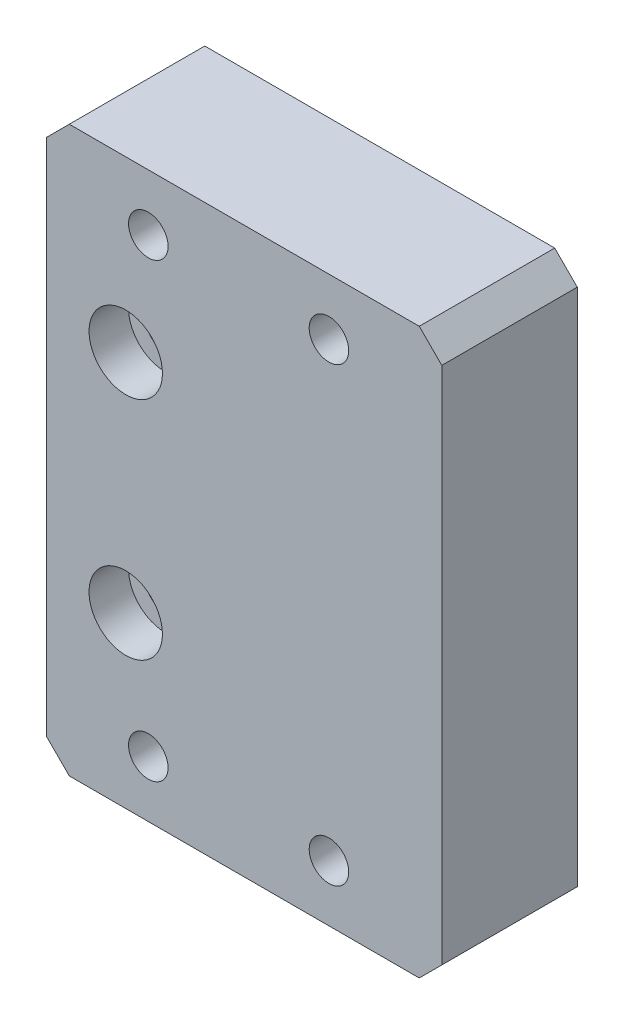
ISO-10303-21;
HEADER;
FILE_DESCRIPTION(('STEP AP214'),'2;1');
FILE_NAME('part.step','',(''),(''),'','','');
FILE_SCHEMA(('AUTOMOTIVE_DESIGN { 1 0 10303 214 1 1 1 1 }'));
ENDSEC;
DATA;
#1=APPLICATION_CONTEXT('core data for automotive mechanical design processes');
#2=APPLICATION_PROTOCOL_DEFINITION('international standard','automotive_design',2000,#1);
#3=PRODUCT_CONTEXT('',#1,'mechanical');
#4=PRODUCT('Part','Part','',(#3));
#5=PRODUCT_RELATED_PRODUCT_CATEGORY('part','',(#4));
#6=PRODUCT_DEFINITION_FORMATION('','',#4);
#7=PRODUCT_DEFINITION_CONTEXT('part definition',#1,'design');
#8=PRODUCT_DEFINITION('design','',#6,#7);
#9=PRODUCT_DEFINITION_SHAPE('','',#8);
#10=(LENGTH_UNIT() NAMED_UNIT(*) SI_UNIT(.MILLI.,.METRE.));
#11=(NAMED_UNIT(*) PLANE_ANGLE_UNIT() SI_UNIT($,.RADIAN.));
#12=(NAMED_UNIT(*) SI_UNIT($,.STERADIAN.) SOLID_ANGLE_UNIT());
#13=UNCERTAINTY_MEASURE_WITH_UNIT(LENGTH_MEASURE(1.E-05),#10,'distance_accuracy_value','');
#14=(GEOMETRIC_REPRESENTATION_CONTEXT(3) GLOBAL_UNCERTAINTY_ASSIGNED_CONTEXT((#13)) GLOBAL_UNIT_ASSIGNED_CONTEXT((#10,
#11,#12)) REPRESENTATION_CONTEXT('',''));
#15=CARTESIAN_POINT('',(0.,0.,0.));
#16=DIRECTION('',(0.,0.,1.));
#17=DIRECTION('',(1.,0.,0.));
#18=AXIS2_PLACEMENT_3D('',#15,#16,#17);
#19=CARTESIAN_POINT('',(0.,0.,12.));
#20=DIRECTION('',(1.,0.,0.));
#21=DIRECTION('',(0.,0.,-1.));
#22=AXIS2_PLACEMENT_3D('',#19,#20,#21);
#23=PLANE('',#22);
#24=DIRECTION('',(0.,-1.,0.));
#25=VECTOR('',#24,1.);
#26=CARTESIAN_POINT('',(0.,0.,0.));
#27=LINE('',#26,#25);
#28=CARTESIAN_POINT('',(0.,48.,0.));
#29=VERTEX_POINT('',#28);
#30=CARTESIAN_POINT('',(0.,2.,0.));
#31=VERTEX_POINT('',#30);
#32=EDGE_CURVE('E125',#29,#31,#27,.T.);
#33=ORIENTED_EDGE('',*,*,#32,.T.);
#34=DIRECTION('',(0.,0.,1.));
#35=VECTOR('',#34,1.);
#36=CARTESIAN_POINT('',(0.,2.,12.));
#37=LINE('',#36,#35);
#38=CARTESIAN_POINT('',(0.,2.,12.));
#39=VERTEX_POINT('',#38);
#40=EDGE_CURVE('E11',#31,#39,#37,.T.);
#41=ORIENTED_EDGE('',*,*,#40,.T.);
#42=DIRECTION('',(0.,-1.,0.));
#43=VECTOR('',#42,1.);
#44=CARTESIAN_POINT('',(0.,0.,12.));
#45=LINE('',#44,#43);
#46=CARTESIAN_POINT('',(0.,48.,12.));
#47=VERTEX_POINT('',#46);
#48=EDGE_CURVE('E144',#47,#39,#45,.T.);
#49=ORIENTED_EDGE('',*,*,#48,.F.);
#50=DIRECTION('',(0.,0.,-1.));
#51=VECTOR('',#50,1.);
#52=CARTESIAN_POINT('',(0.,48.,12.));
#53=LINE('',#52,#51);
#54=EDGE_CURVE('E45',#47,#29,#53,.T.);
#55=ORIENTED_EDGE('',*,*,#54,.T.);
#56=EDGE_LOOP('',(#33,#41,#49,#55));
#57=FACE_BOUND('',#56,.T.);
#58=ADVANCED_FACE('F37',(#57),#23,.F.);
#59=CARTESIAN_POINT('',(0.,0.,12.));
#60=DIRECTION('',(0.,1.,0.));
#61=DIRECTION('',(0.,0.,1.));
#62=AXIS2_PLACEMENT_3D('',#59,#60,#61);
#63=PLANE('',#62);
#64=DIRECTION('',(1.,0.,0.));
#65=VECTOR('',#64,1.);
#66=CARTESIAN_POINT('',(0.,0.,0.));
#67=LINE('',#66,#65);
#68=CARTESIAN_POINT('',(2.00000000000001,0.,0.));
#69=VERTEX_POINT('',#68);
#70=CARTESIAN_POINT('',(33.,0.,0.));
#71=VERTEX_POINT('',#70);
#72=EDGE_CURVE('E109',#69,#71,#67,.T.);
#73=ORIENTED_EDGE('',*,*,#72,.T.);
#74=DIRECTION('',(0.,0.,1.));
#75=VECTOR('',#74,1.);
#76=CARTESIAN_POINT('',(33.,0.,12.));
#77=LINE('',#76,#75);
#78=CARTESIAN_POINT('',(33.,0.,12.));
#79=VERTEX_POINT('',#78);
#80=EDGE_CURVE('E115',#71,#79,#77,.T.);
#81=ORIENTED_EDGE('',*,*,#80,.T.);
#82=DIRECTION('',(1.,0.,0.));
#83=VECTOR('',#82,1.);
#84=CARTESIAN_POINT('',(0.,0.,12.));
#85=LINE('',#84,#83);
#86=CARTESIAN_POINT('',(2.00000000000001,0.,12.));
#87=VERTEX_POINT('',#86);
#88=EDGE_CURVE('E112',#87,#79,#85,.T.);
#89=ORIENTED_EDGE('',*,*,#88,.F.);
#90=DIRECTION('',(0.,0.,-1.));
#91=VECTOR('',#90,1.);
#92=CARTESIAN_POINT('',(2.00000000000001,0.,12.));
#93=LINE('',#92,#91);
#94=EDGE_CURVE('E105',#87,#69,#93,.T.);
#95=ORIENTED_EDGE('',*,*,#94,.T.);
#96=EDGE_LOOP('',(#73,#81,#89,#95));
#97=FACE_BOUND('',#96,.T.);
#98=ADVANCED_FACE('F107',(#97),#63,.F.);
#99=CARTESIAN_POINT('',(35.,0.,12.));
#100=DIRECTION('',(-1.,0.,0.));
#101=DIRECTION('',(0.,0.,1.));
#102=AXIS2_PLACEMENT_3D('',#99,#100,#101);
#103=PLANE('',#102);
#104=DIRECTION('',(0.,1.,0.));
#105=VECTOR('',#104,1.);
#106=CARTESIAN_POINT('',(35.,0.,12.));
#107=LINE('',#106,#105);
#108=CARTESIAN_POINT('',(35.,2.,12.));
#109=VERTEX_POINT('',#108);
#110=CARTESIAN_POINT('',(35.,48.,12.));
#111=VERTEX_POINT('',#110);
#112=EDGE_CURVE('E157',#109,#111,#107,.T.);
#113=ORIENTED_EDGE('',*,*,#112,.F.);
#114=DIRECTION('',(0.,0.,-1.));
#115=VECTOR('',#114,1.);
#116=CARTESIAN_POINT('',(35.,2.,12.));
#117=LINE('',#116,#115);
#118=CARTESIAN_POINT('',(35.,2.,0.));
#119=VERTEX_POINT('',#118);
#120=EDGE_CURVE('E132',#109,#119,#117,.T.);
#121=ORIENTED_EDGE('',*,*,#120,.T.);
#122=DIRECTION('',(0.,1.,0.));
#123=VECTOR('',#122,1.);
#124=CARTESIAN_POINT('',(35.,0.,0.));
#125=LINE('',#124,#123);
#126=CARTESIAN_POINT('',(35.,48.,0.));
#127=VERTEX_POINT('',#126);
#128=EDGE_CURVE('E124',#119,#127,#125,.T.);
#129=ORIENTED_EDGE('',*,*,#128,.T.);
#130=DIRECTION('',(0.,0.,1.));
#131=VECTOR('',#130,1.);
#132=CARTESIAN_POINT('',(35.,48.,12.));
#133=LINE('',#132,#131);
#134=EDGE_CURVE('E172',#127,#111,#133,.T.);
#135=ORIENTED_EDGE('',*,*,#134,.T.);
#136=EDGE_LOOP('',(#113,#121,#129,#135));
#137=FACE_BOUND('',#136,.T.);
#138=ADVANCED_FACE('F177',(#137),#103,.F.);
#139=CARTESIAN_POINT('',(0.,50.,12.));
#140=DIRECTION('',(0.,-1.,0.));
#141=DIRECTION('',(0.,0.,-1.));
#142=AXIS2_PLACEMENT_3D('',#139,#140,#141);
#143=PLANE('',#142);
#144=DIRECTION('',(-1.,0.,0.));
#145=VECTOR('',#144,1.);
#146=CARTESIAN_POINT('',(0.,50.,12.));
#147=LINE('',#146,#145);
#148=CARTESIAN_POINT('',(33.,50.,12.));
#149=VERTEX_POINT('',#148);
#150=CARTESIAN_POINT('',(2.,50.,12.));
#151=VERTEX_POINT('',#150);
#152=EDGE_CURVE('E116',#149,#151,#147,.T.);
#153=ORIENTED_EDGE('',*,*,#152,.F.);
#154=DIRECTION('',(0.,0.,-1.));
#155=VECTOR('',#154,1.);
#156=CARTESIAN_POINT('',(33.,50.,12.));
#157=LINE('',#156,#155);
#158=CARTESIAN_POINT('',(33.,50.,0.));
#159=VERTEX_POINT('',#158);
#160=EDGE_CURVE('E59',#149,#159,#157,.T.);
#161=ORIENTED_EDGE('',*,*,#160,.T.);
#162=DIRECTION('',(-1.,0.,0.));
#163=VECTOR('',#162,1.);
#164=CARTESIAN_POINT('',(0.,50.,0.));
#165=LINE('',#164,#163);
#166=CARTESIAN_POINT('',(2.,50.,0.));
#167=VERTEX_POINT('',#166);
#168=EDGE_CURVE('E152',#159,#167,#165,.T.);
#169=ORIENTED_EDGE('',*,*,#168,.T.);
#170=DIRECTION('',(0.,0.,1.));
#171=VECTOR('',#170,1.);
#172=CARTESIAN_POINT('',(2.,50.,12.));
#173=LINE('',#172,#171);
#174=EDGE_CURVE('E137',#167,#151,#173,.T.);
#175=ORIENTED_EDGE('',*,*,#174,.T.);
#176=EDGE_LOOP('',(#153,#161,#169,#175));
#177=FACE_BOUND('',#176,.T.);
#178=ADVANCED_FACE('F151',(#177),#143,.F.);
#179=CARTESIAN_POINT('',(0.,0.,12.));
#180=DIRECTION('',(0.,0.,-1.));
#181=DIRECTION('',(-1.,0.,0.));
#182=AXIS2_PLACEMENT_3D('',#179,#180,#181);
#183=PLANE('',#182);
#184=CARTESIAN_POINT('',(25.,45.,12.));
#185=DIRECTION('',(0.,0.,-1.));
#186=DIRECTION('',(-1.,0.,0.));
#187=AXIS2_PLACEMENT_3D('',#184,#185,#186);
#188=CIRCLE('',#187,1.74999999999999);
#189=CARTESIAN_POINT('',(23.25,45.,12.));
#190=VERTEX_POINT('',#189);
#191=EDGE_CURVE('E243',#190,#190,#188,.T.);
#192=ORIENTED_EDGE('',*,*,#191,.T.);
#193=EDGE_LOOP('',(#192));
#194=FACE_BOUND('',#193,.T.);
#195=CARTESIAN_POINT('',(25.,5.,12.));
#196=DIRECTION('',(0.,0.,-1.));
#197=DIRECTION('',(-1.,0.,0.));
#198=AXIS2_PLACEMENT_3D('',#195,#196,#197);
#199=CIRCLE('',#198,1.74999999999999);
#200=CARTESIAN_POINT('',(23.25,5.,12.));
#201=VERTEX_POINT('',#200);
#202=EDGE_CURVE('E231',#201,#201,#199,.T.);
#203=ORIENTED_EDGE('',*,*,#202,.T.);
#204=EDGE_LOOP('',(#203));
#205=FACE_BOUND('',#204,.T.);
#206=CARTESIAN_POINT('',(9.,45.,12.));
#207=DIRECTION('',(0.,0.,-1.));
#208=DIRECTION('',(-1.,0.,0.));
#209=AXIS2_PLACEMENT_3D('',#206,#207,#208);
#210=CIRCLE('',#209,1.75);
#211=CARTESIAN_POINT('',(7.25,45.,12.));
#212=VERTEX_POINT('',#211);
#213=EDGE_CURVE('E219',#212,#212,#210,.T.);
#214=ORIENTED_EDGE('',*,*,#213,.T.);
#215=EDGE_LOOP('',(#214));
#216=FACE_BOUND('',#215,.T.);
#217=CARTESIAN_POINT('',(9.,5.,12.));
#218=DIRECTION('',(0.,0.,-1.));
#219=DIRECTION('',(-1.,0.,0.));
#220=AXIS2_PLACEMENT_3D('',#217,#218,#219);
#221=CIRCLE('',#220,1.75);
#222=CARTESIAN_POINT('',(7.25,5.,12.));
#223=VERTEX_POINT('',#222);
#224=EDGE_CURVE('E207',#223,#223,#221,.T.);
#225=ORIENTED_EDGE('',*,*,#224,.T.);
#226=EDGE_LOOP('',(#225));
#227=FACE_BOUND('',#226,.T.);
#228=CARTESIAN_POINT('',(7.,35.,12.));
#229=DIRECTION('',(0.,0.,1.));
#230=DIRECTION('',(1.,0.,0.));
#231=AXIS2_PLACEMENT_3D('',#228,#229,#230);
#232=CIRCLE('',#231,3.25);
#233=CARTESIAN_POINT('',(10.25,35.,12.));
#234=VERTEX_POINT('',#233);
#235=EDGE_CURVE('E204',#234,#234,#232,.T.);
#236=ORIENTED_EDGE('',*,*,#235,.F.);
#237=EDGE_LOOP('',(#236));
#238=FACE_BOUND('',#237,.T.);
#239=CARTESIAN_POINT('',(7.,15.,12.));
#240=DIRECTION('',(0.,0.,1.));
#241=DIRECTION('',(1.,0.,0.));
#242=AXIS2_PLACEMENT_3D('',#239,#240,#241);
#243=CIRCLE('',#242,3.25);
#244=CARTESIAN_POINT('',(10.25,15.,12.));
#245=VERTEX_POINT('',#244);
#246=EDGE_CURVE('E192',#245,#245,#243,.T.);
#247=ORIENTED_EDGE('',*,*,#246,.F.);
#248=EDGE_LOOP('',(#247));
#249=FACE_BOUND('',#248,.T.);
#250=ORIENTED_EDGE('',*,*,#88,.T.);
#251=DIRECTION('',(-0.707106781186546,-0.707106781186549,0.));
#252=VECTOR('',#251,1.);
#253=CARTESIAN_POINT('',(33.,0.,12.));
#254=LINE('',#253,#252);
#255=EDGE_CURVE('E170',#79,#109,#254,.F.);
#256=ORIENTED_EDGE('',*,*,#255,.T.);
#257=ORIENTED_EDGE('',*,*,#112,.T.);
#258=DIRECTION('',(0.707106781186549,-0.707106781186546,0.));
#259=VECTOR('',#258,1.);
#260=CARTESIAN_POINT('',(35.,48.,12.));
#261=LINE('',#260,#259);
#262=EDGE_CURVE('E156',#111,#149,#261,.F.);
#263=ORIENTED_EDGE('',*,*,#262,.T.);
#264=ORIENTED_EDGE('',*,*,#152,.T.);
#265=DIRECTION('',(0.707106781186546,0.707106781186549,0.));
#266=VECTOR('',#265,1.);
#267=CARTESIAN_POINT('',(2.,50.,12.));
#268=LINE('',#267,#266);
#269=EDGE_CURVE('E149',#151,#47,#268,.F.);
#270=ORIENTED_EDGE('',*,*,#269,.T.);
#271=ORIENTED_EDGE('',*,*,#48,.T.);
#272=DIRECTION('',(-0.707106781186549,0.707106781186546,0.));
#273=VECTOR('',#272,1.);
#274=CARTESIAN_POINT('',(0.,2.,12.));
#275=LINE('',#274,#273);
#276=EDGE_CURVE('E167',#39,#87,#275,.F.);
#277=ORIENTED_EDGE('',*,*,#276,.T.);
#278=EDGE_LOOP('',(#250,#256,#257,#263,#264,#270,#271,#277));
#279=FACE_BOUND('',#278,.T.);
#280=ADVANCED_FACE('F154',(#194,#205,#216,#227,#238,#249,#279),#183,.F.);
#281=CARTESIAN_POINT('',(0.,0.,0.));
#282=DIRECTION('',(0.,0.,-1.));
#283=DIRECTION('',(-1.,0.,0.));
#284=AXIS2_PLACEMENT_3D('',#281,#282,#283);
#285=PLANE('',#284);
#286=CARTESIAN_POINT('',(25.,45.,0.));
#287=DIRECTION('',(0.,0.,-1.));
#288=DIRECTION('',(-1.,0.,0.));
#289=AXIS2_PLACEMENT_3D('',#286,#287,#288);
#290=CIRCLE('',#289,3.25);
#291=CARTESIAN_POINT('',(21.75,45.,0.));
#292=VERTEX_POINT('',#291);
#293=EDGE_CURVE('E252',#292,#292,#290,.T.);
#294=ORIENTED_EDGE('',*,*,#293,.F.);
#295=EDGE_LOOP('',(#294));
#296=FACE_BOUND('',#295,.T.);
#297=CARTESIAN_POINT('',(25.,5.,0.));
#298=DIRECTION('',(0.,0.,-1.));
#299=DIRECTION('',(-1.,0.,0.));
#300=AXIS2_PLACEMENT_3D('',#297,#298,#299);
#301=CIRCLE('',#300,3.25);
#302=CARTESIAN_POINT('',(21.75,5.,0.));
#303=VERTEX_POINT('',#302);
#304=EDGE_CURVE('E240',#303,#303,#301,.T.);
#305=ORIENTED_EDGE('',*,*,#304,.F.);
#306=EDGE_LOOP('',(#305));
#307=FACE_BOUND('',#306,.T.);
#308=CARTESIAN_POINT('',(9.,45.,0.));
#309=DIRECTION('',(0.,0.,-1.));
#310=DIRECTION('',(-1.,0.,0.));
#311=AXIS2_PLACEMENT_3D('',#308,#309,#310);
#312=CIRCLE('',#311,3.25);
#313=CARTESIAN_POINT('',(5.75000000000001,45.,0.));
#314=VERTEX_POINT('',#313);
#315=EDGE_CURVE('E228',#314,#314,#312,.T.);
#316=ORIENTED_EDGE('',*,*,#315,.F.);
#317=EDGE_LOOP('',(#316));
#318=FACE_BOUND('',#317,.T.);
#319=CARTESIAN_POINT('',(9.,5.,0.));
#320=DIRECTION('',(0.,0.,-1.));
#321=DIRECTION('',(-1.,0.,0.));
#322=AXIS2_PLACEMENT_3D('',#319,#320,#321);
#323=CIRCLE('',#322,3.25);
#324=CARTESIAN_POINT('',(5.75000000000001,5.,0.));
#325=VERTEX_POINT('',#324);
#326=EDGE_CURVE('E216',#325,#325,#323,.T.);
#327=ORIENTED_EDGE('',*,*,#326,.F.);
#328=EDGE_LOOP('',(#327));
#329=FACE_BOUND('',#328,.T.);
#330=CARTESIAN_POINT('',(7.,35.,0.));
#331=DIRECTION('',(0.,0.,1.));
#332=DIRECTION('',(1.,0.,0.));
#333=AXIS2_PLACEMENT_3D('',#330,#331,#332);
#334=CIRCLE('',#333,1.75);
#335=CARTESIAN_POINT('',(8.75,35.,0.));
#336=VERTEX_POINT('',#335);
#337=EDGE_CURVE('E195',#336,#336,#334,.T.);
#338=ORIENTED_EDGE('',*,*,#337,.T.);
#339=EDGE_LOOP('',(#338));
#340=FACE_BOUND('',#339,.T.);
#341=CARTESIAN_POINT('',(7.,15.,0.));
#342=DIRECTION('',(0.,0.,1.));
#343=DIRECTION('',(1.,0.,0.));
#344=AXIS2_PLACEMENT_3D('',#341,#342,#343);
#345=CIRCLE('',#344,1.75);
#346=CARTESIAN_POINT('',(8.75,15.,0.));
#347=VERTEX_POINT('',#346);
#348=EDGE_CURVE('E146',#347,#347,#345,.T.);
#349=ORIENTED_EDGE('',*,*,#348,.T.);
#350=EDGE_LOOP('',(#349));
#351=FACE_BOUND('',#350,.T.);
#352=ORIENTED_EDGE('',*,*,#128,.F.);
#353=DIRECTION('',(0.707106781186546,0.707106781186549,0.));
#354=VECTOR('',#353,1.);
#355=CARTESIAN_POINT('',(16.5000000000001,-16.5,0.));
#356=LINE('',#355,#354);
#357=EDGE_CURVE('E123',#119,#71,#356,.F.);
#358=ORIENTED_EDGE('',*,*,#357,.T.);
#359=ORIENTED_EDGE('',*,*,#72,.F.);
#360=DIRECTION('',(0.707106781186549,-0.707106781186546,0.));
#361=VECTOR('',#360,1.);
#362=CARTESIAN_POINT('',(1.,1.,0.));
#363=LINE('',#362,#361);
#364=EDGE_CURVE('E120',#69,#31,#363,.F.);
#365=ORIENTED_EDGE('',*,*,#364,.T.);
#366=ORIENTED_EDGE('',*,*,#32,.F.);
#367=DIRECTION('',(-0.707106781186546,-0.707106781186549,0.));
#368=VECTOR('',#367,1.);
#369=CARTESIAN_POINT('',(-24.,23.9999999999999,0.));
#370=LINE('',#369,#368);
#371=EDGE_CURVE('E52',#29,#167,#370,.F.);
#372=ORIENTED_EDGE('',*,*,#371,.T.);
#373=ORIENTED_EDGE('',*,*,#168,.F.);
#374=DIRECTION('',(-0.707106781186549,0.707106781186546,0.));
#375=VECTOR('',#374,1.);
#376=CARTESIAN_POINT('',(41.4999999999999,41.5000000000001,0.));
#377=LINE('',#376,#375);
#378=EDGE_CURVE('E129',#159,#127,#377,.F.);
#379=ORIENTED_EDGE('',*,*,#378,.T.);
#380=EDGE_LOOP('',(#352,#358,#359,#365,#366,#372,#373,#379));
#381=FACE_BOUND('',#380,.T.);
#382=ADVANCED_FACE('F119',(#296,#307,#318,#329,#340,#351,#381),#285,.T.);
#383=CARTESIAN_POINT('',(7.,15.,12.));
#384=DIRECTION('',(0.,0.,1.));
#385=DIRECTION('',(1.,0.,0.));
#386=AXIS2_PLACEMENT_3D('',#383,#384,#385);
#387=CYLINDRICAL_SURFACE('',#386,1.75);
#388=ORIENTED_EDGE('',*,*,#348,.F.);
#389=EDGE_LOOP('',(#388));
#390=FACE_BOUND('',#389,.T.);
#391=CARTESIAN_POINT('',(7.,15.,8.5));
#392=DIRECTION('',(0.,0.,1.));
#393=DIRECTION('',(1.,0.,0.));
#394=AXIS2_PLACEMENT_3D('',#391,#392,#393);
#395=CIRCLE('',#394,1.75000000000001);
#396=CARTESIAN_POINT('',(8.75000000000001,15.,8.5));
#397=VERTEX_POINT('',#396);
#398=EDGE_CURVE('E186',#397,#397,#395,.T.);
#399=ORIENTED_EDGE('',*,*,#398,.T.);
#400=EDGE_LOOP('',(#399));
#401=FACE_BOUND('',#400,.T.);
#402=ADVANCED_FACE('F260',(#390,#401),#387,.F.);
#403=CARTESIAN_POINT('',(8.75000000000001,15.,8.5));
#404=DIRECTION('',(0.,0.,-1.));
#405=DIRECTION('',(-1.,0.,0.));
#406=AXIS2_PLACEMENT_3D('',#403,#404,#405);
#407=PLANE('',#406);
#408=ORIENTED_EDGE('',*,*,#398,.F.);
#409=EDGE_LOOP('',(#408));
#410=FACE_BOUND('',#409,.T.);
#411=CARTESIAN_POINT('',(7.,15.,8.5));
#412=DIRECTION('',(0.,0.,1.));
#413=DIRECTION('',(1.,0.,0.));
#414=AXIS2_PLACEMENT_3D('',#411,#412,#413);
#415=CIRCLE('',#414,3.25);
#416=CARTESIAN_POINT('',(10.25,15.,8.5));
#417=VERTEX_POINT('',#416);
#418=EDGE_CURVE('E189',#417,#417,#415,.T.);
#419=ORIENTED_EDGE('',*,*,#418,.T.);
#420=EDGE_LOOP('',(#419));
#421=FACE_BOUND('',#420,.T.);
#422=ADVANCED_FACE('F274',(#410,#421),#407,.F.);
#423=CARTESIAN_POINT('',(7.,15.,12.));
#424=DIRECTION('',(0.,0.,1.));
#425=DIRECTION('',(1.,0.,0.));
#426=AXIS2_PLACEMENT_3D('',#423,#424,#425);
#427=CYLINDRICAL_SURFACE('',#426,3.25);
#428=ORIENTED_EDGE('',*,*,#418,.F.);
#429=EDGE_LOOP('',(#428));
#430=FACE_BOUND('',#429,.T.);
#431=ORIENTED_EDGE('',*,*,#246,.T.);
#432=EDGE_LOOP('',(#431));
#433=FACE_BOUND('',#432,.T.);
#434=ADVANCED_FACE('F280',(#430,#433),#427,.F.);
#435=CARTESIAN_POINT('',(7.,35.,12.));
#436=DIRECTION('',(0.,0.,1.));
#437=DIRECTION('',(1.,0.,0.));
#438=AXIS2_PLACEMENT_3D('',#435,#436,#437);
#439=CYLINDRICAL_SURFACE('',#438,1.75);
#440=ORIENTED_EDGE('',*,*,#337,.F.);
#441=EDGE_LOOP('',(#440));
#442=FACE_BOUND('',#441,.T.);
#443=CARTESIAN_POINT('',(7.,35.,8.5));
#444=DIRECTION('',(0.,0.,1.));
#445=DIRECTION('',(1.,0.,0.));
#446=AXIS2_PLACEMENT_3D('',#443,#444,#445);
#447=CIRCLE('',#446,1.75000000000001);
#448=CARTESIAN_POINT('',(8.75000000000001,35.,8.5));
#449=VERTEX_POINT('',#448);
#450=EDGE_CURVE('E198',#449,#449,#447,.T.);
#451=ORIENTED_EDGE('',*,*,#450,.T.);
#452=EDGE_LOOP('',(#451));
#453=FACE_BOUND('',#452,.T.);
#454=ADVANCED_FACE('F286',(#442,#453),#439,.F.);
#455=CARTESIAN_POINT('',(8.75000000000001,35.,8.5));
#456=DIRECTION('',(0.,0.,-1.));
#457=DIRECTION('',(-1.,0.,0.));
#458=AXIS2_PLACEMENT_3D('',#455,#456,#457);
#459=PLANE('',#458);
#460=ORIENTED_EDGE('',*,*,#450,.F.);
#461=EDGE_LOOP('',(#460));
#462=FACE_BOUND('',#461,.T.);
#463=CARTESIAN_POINT('',(7.,35.,8.5));
#464=DIRECTION('',(0.,0.,1.));
#465=DIRECTION('',(1.,0.,0.));
#466=AXIS2_PLACEMENT_3D('',#463,#464,#465);
#467=CIRCLE('',#466,3.25);
#468=CARTESIAN_POINT('',(10.25,35.,8.5));
#469=VERTEX_POINT('',#468);
#470=EDGE_CURVE('E201',#469,#469,#467,.T.);
#471=ORIENTED_EDGE('',*,*,#470,.T.);
#472=EDGE_LOOP('',(#471));
#473=FACE_BOUND('',#472,.T.);
#474=ADVANCED_FACE('F496',(#462,#473),#459,.F.);
#475=CARTESIAN_POINT('',(7.,35.,12.));
#476=DIRECTION('',(0.,0.,1.));
#477=DIRECTION('',(1.,0.,0.));
#478=AXIS2_PLACEMENT_3D('',#475,#476,#477);
#479=CYLINDRICAL_SURFACE('',#478,3.25);
#480=ORIENTED_EDGE('',*,*,#470,.F.);
#481=EDGE_LOOP('',(#480));
#482=FACE_BOUND('',#481,.T.);
#483=ORIENTED_EDGE('',*,*,#235,.T.);
#484=EDGE_LOOP('',(#483));
#485=FACE_BOUND('',#484,.T.);
#486=ADVANCED_FACE('F486',(#482,#485),#479,.F.);
#487=CARTESIAN_POINT('',(9.,5.,0.));
#488=DIRECTION('',(0.,0.,-1.));
#489=DIRECTION('',(-1.,0.,0.));
#490=AXIS2_PLACEMENT_3D('',#487,#488,#489);
#491=CYLINDRICAL_SURFACE('',#490,1.75);
#492=ORIENTED_EDGE('',*,*,#224,.F.);
#493=EDGE_LOOP('',(#492));
#494=FACE_BOUND('',#493,.T.);
#495=CARTESIAN_POINT('',(9.,5.,3.5));
#496=DIRECTION('',(0.,0.,-1.));
#497=DIRECTION('',(-1.,0.,0.));
#498=AXIS2_PLACEMENT_3D('',#495,#496,#497);
#499=CIRCLE('',#498,1.75000000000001);
#500=CARTESIAN_POINT('',(7.24999999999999,5.,3.5));
#501=VERTEX_POINT('',#500);
#502=EDGE_CURVE('E210',#501,#501,#499,.T.);
#503=ORIENTED_EDGE('',*,*,#502,.T.);
#504=EDGE_LOOP('',(#503));
#505=FACE_BOUND('',#504,.T.);
#506=ADVANCED_FACE('F476',(#494,#505),#491,.F.);
#507=CARTESIAN_POINT('',(10.75,5.,3.5));
#508=DIRECTION('',(0.,0.,1.));
#509=DIRECTION('',(1.,0.,0.));
#510=AXIS2_PLACEMENT_3D('',#507,#508,#509);
#511=PLANE('',#510);
#512=ORIENTED_EDGE('',*,*,#502,.F.);
#513=EDGE_LOOP('',(#512));
#514=FACE_BOUND('',#513,.T.);
#515=CARTESIAN_POINT('',(9.,5.,3.5));
#516=DIRECTION('',(0.,0.,-1.));
#517=DIRECTION('',(-1.,0.,0.));
#518=AXIS2_PLACEMENT_3D('',#515,#516,#517);
#519=CIRCLE('',#518,3.25);
#520=CARTESIAN_POINT('',(5.75000000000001,5.,3.5));
#521=VERTEX_POINT('',#520);
#522=EDGE_CURVE('E213',#521,#521,#519,.T.);
#523=ORIENTED_EDGE('',*,*,#522,.T.);
#524=EDGE_LOOP('',(#523));
#525=FACE_BOUND('',#524,.T.);
#526=ADVANCED_FACE('F466',(#514,#525),#511,.F.);
#527=CARTESIAN_POINT('',(9.,5.,0.));
#528=DIRECTION('',(0.,0.,-1.));
#529=DIRECTION('',(-1.,0.,0.));
#530=AXIS2_PLACEMENT_3D('',#527,#528,#529);
#531=CYLINDRICAL_SURFACE('',#530,3.25);
#532=ORIENTED_EDGE('',*,*,#522,.F.);
#533=EDGE_LOOP('',(#532));
#534=FACE_BOUND('',#533,.T.);
#535=ORIENTED_EDGE('',*,*,#326,.T.);
#536=EDGE_LOOP('',(#535));
#537=FACE_BOUND('',#536,.T.);
#538=ADVANCED_FACE('F456',(#534,#537),#531,.F.);
#539=CARTESIAN_POINT('',(9.,45.,0.));
#540=DIRECTION('',(0.,0.,-1.));
#541=DIRECTION('',(-1.,0.,0.));
#542=AXIS2_PLACEMENT_3D('',#539,#540,#541);
#543=CYLINDRICAL_SURFACE('',#542,1.75);
#544=ORIENTED_EDGE('',*,*,#213,.F.);
#545=EDGE_LOOP('',(#544));
#546=FACE_BOUND('',#545,.T.);
#547=CARTESIAN_POINT('',(9.,45.,3.5));
#548=DIRECTION('',(0.,0.,-1.));
#549=DIRECTION('',(-1.,0.,0.));
#550=AXIS2_PLACEMENT_3D('',#547,#548,#549);
#551=CIRCLE('',#550,1.75000000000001);
#552=CARTESIAN_POINT('',(7.24999999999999,45.,3.5));
#553=VERTEX_POINT('',#552);
#554=EDGE_CURVE('E222',#553,#553,#551,.T.);
#555=ORIENTED_EDGE('',*,*,#554,.T.);
#556=EDGE_LOOP('',(#555));
#557=FACE_BOUND('',#556,.T.);
#558=ADVANCED_FACE('F446',(#546,#557),#543,.F.);
#559=CARTESIAN_POINT('',(10.75,45.,3.5));
#560=DIRECTION('',(0.,0.,1.));
#561=DIRECTION('',(1.,0.,0.));
#562=AXIS2_PLACEMENT_3D('',#559,#560,#561);
#563=PLANE('',#562);
#564=ORIENTED_EDGE('',*,*,#554,.F.);
#565=EDGE_LOOP('',(#564));
#566=FACE_BOUND('',#565,.T.);
#567=CARTESIAN_POINT('',(9.,45.,3.5));
#568=DIRECTION('',(0.,0.,-1.));
#569=DIRECTION('',(-1.,0.,0.));
#570=AXIS2_PLACEMENT_3D('',#567,#568,#569);
#571=CIRCLE('',#570,3.25);
#572=CARTESIAN_POINT('',(5.75000000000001,45.,3.5));
#573=VERTEX_POINT('',#572);
#574=EDGE_CURVE('E225',#573,#573,#571,.T.);
#575=ORIENTED_EDGE('',*,*,#574,.T.);
#576=EDGE_LOOP('',(#575));
#577=FACE_BOUND('',#576,.T.);
#578=ADVANCED_FACE('F436',(#566,#577),#563,.F.);
#579=CARTESIAN_POINT('',(9.,45.,0.));
#580=DIRECTION('',(0.,0.,-1.));
#581=DIRECTION('',(-1.,0.,0.));
#582=AXIS2_PLACEMENT_3D('',#579,#580,#581);
#583=CYLINDRICAL_SURFACE('',#582,3.25);
#584=ORIENTED_EDGE('',*,*,#574,.F.);
#585=EDGE_LOOP('',(#584));
#586=FACE_BOUND('',#585,.T.);
#587=ORIENTED_EDGE('',*,*,#315,.T.);
#588=EDGE_LOOP('',(#587));
#589=FACE_BOUND('',#588,.T.);
#590=ADVANCED_FACE('F426',(#586,#589),#583,.F.);
#591=CARTESIAN_POINT('',(25.,5.,0.));
#592=DIRECTION('',(0.,0.,-1.));
#593=DIRECTION('',(-1.,0.,0.));
#594=AXIS2_PLACEMENT_3D('',#591,#592,#593);
#595=CYLINDRICAL_SURFACE('',#594,1.75);
#596=ORIENTED_EDGE('',*,*,#202,.F.);
#597=EDGE_LOOP('',(#596));
#598=FACE_BOUND('',#597,.T.);
#599=CARTESIAN_POINT('',(25.,5.,3.5));
#600=DIRECTION('',(0.,0.,-1.));
#601=DIRECTION('',(-1.,0.,0.));
#602=AXIS2_PLACEMENT_3D('',#599,#600,#601);
#603=CIRCLE('',#602,1.75000000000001);
#604=CARTESIAN_POINT('',(23.25,5.,3.5));
#605=VERTEX_POINT('',#604);
#606=EDGE_CURVE('E234',#605,#605,#603,.T.);
#607=ORIENTED_EDGE('',*,*,#606,.T.);
#608=EDGE_LOOP('',(#607));
#609=FACE_BOUND('',#608,.T.);
#610=ADVANCED_FACE('F416',(#598,#609),#595,.F.);
#611=CARTESIAN_POINT('',(26.75,5.,3.5));
#612=DIRECTION('',(0.,0.,1.));
#613=DIRECTION('',(1.,0.,0.));
#614=AXIS2_PLACEMENT_3D('',#611,#612,#613);
#615=PLANE('',#614);
#616=ORIENTED_EDGE('',*,*,#606,.F.);
#617=EDGE_LOOP('',(#616));
#618=FACE_BOUND('',#617,.T.);
#619=CARTESIAN_POINT('',(25.,5.,3.5));
#620=DIRECTION('',(0.,0.,-1.));
#621=DIRECTION('',(-1.,0.,0.));
#622=AXIS2_PLACEMENT_3D('',#619,#620,#621);
#623=CIRCLE('',#622,3.25);
#624=CARTESIAN_POINT('',(21.75,5.,3.5));
#625=VERTEX_POINT('',#624);
#626=EDGE_CURVE('E237',#625,#625,#623,.T.);
#627=ORIENTED_EDGE('',*,*,#626,.T.);
#628=EDGE_LOOP('',(#627));
#629=FACE_BOUND('',#628,.T.);
#630=ADVANCED_FACE('F406',(#618,#629),#615,.F.);
#631=CARTESIAN_POINT('',(25.,5.,0.));
#632=DIRECTION('',(0.,0.,-1.));
#633=DIRECTION('',(-1.,0.,0.));
#634=AXIS2_PLACEMENT_3D('',#631,#632,#633);
#635=CYLINDRICAL_SURFACE('',#634,3.25);
#636=ORIENTED_EDGE('',*,*,#626,.F.);
#637=EDGE_LOOP('',(#636));
#638=FACE_BOUND('',#637,.T.);
#639=ORIENTED_EDGE('',*,*,#304,.T.);
#640=EDGE_LOOP('',(#639));
#641=FACE_BOUND('',#640,.T.);
#642=ADVANCED_FACE('F396',(#638,#641),#635,.F.);
#643=CARTESIAN_POINT('',(25.,45.,0.));
#644=DIRECTION('',(0.,0.,-1.));
#645=DIRECTION('',(-1.,0.,0.));
#646=AXIS2_PLACEMENT_3D('',#643,#644,#645);
#647=CYLINDRICAL_SURFACE('',#646,1.75);
#648=ORIENTED_EDGE('',*,*,#191,.F.);
#649=EDGE_LOOP('',(#648));
#650=FACE_BOUND('',#649,.T.);
#651=CARTESIAN_POINT('',(25.,45.,3.5));
#652=DIRECTION('',(0.,0.,-1.));
#653=DIRECTION('',(-1.,0.,0.));
#654=AXIS2_PLACEMENT_3D('',#651,#652,#653);
#655=CIRCLE('',#654,1.75000000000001);
#656=CARTESIAN_POINT('',(23.25,45.,3.5));
#657=VERTEX_POINT('',#656);
#658=EDGE_CURVE('E246',#657,#657,#655,.T.);
#659=ORIENTED_EDGE('',*,*,#658,.T.);
#660=EDGE_LOOP('',(#659));
#661=FACE_BOUND('',#660,.T.);
#662=ADVANCED_FACE('F386',(#650,#661),#647,.F.);
#663=CARTESIAN_POINT('',(26.75,45.,3.5));
#664=DIRECTION('',(0.,0.,1.));
#665=DIRECTION('',(1.,0.,0.));
#666=AXIS2_PLACEMENT_3D('',#663,#664,#665);
#667=PLANE('',#666);
#668=ORIENTED_EDGE('',*,*,#658,.F.);
#669=EDGE_LOOP('',(#668));
#670=FACE_BOUND('',#669,.T.);
#671=CARTESIAN_POINT('',(25.,45.,3.5));
#672=DIRECTION('',(0.,0.,-1.));
#673=DIRECTION('',(-1.,0.,0.));
#674=AXIS2_PLACEMENT_3D('',#671,#672,#673);
#675=CIRCLE('',#674,3.25);
#676=CARTESIAN_POINT('',(21.75,45.,3.5));
#677=VERTEX_POINT('',#676);
#678=EDGE_CURVE('E249',#677,#677,#675,.T.);
#679=ORIENTED_EDGE('',*,*,#678,.T.);
#680=EDGE_LOOP('',(#679));
#681=FACE_BOUND('',#680,.T.);
#682=ADVANCED_FACE('F376',(#670,#681),#667,.F.);
#683=CARTESIAN_POINT('',(25.,45.,0.));
#684=DIRECTION('',(0.,0.,-1.));
#685=DIRECTION('',(-1.,0.,0.));
#686=AXIS2_PLACEMENT_3D('',#683,#684,#685);
#687=CYLINDRICAL_SURFACE('',#686,3.25);
#688=ORIENTED_EDGE('',*,*,#678,.F.);
#689=EDGE_LOOP('',(#688));
#690=FACE_BOUND('',#689,.T.);
#691=ORIENTED_EDGE('',*,*,#293,.T.);
#692=EDGE_LOOP('',(#691));
#693=FACE_BOUND('',#692,.T.);
#694=ADVANCED_FACE('F256',(#690,#693),#687,.F.);
#695=CARTESIAN_POINT('',(33.,0.,12.));
#696=DIRECTION('',(-0.707106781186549,0.707106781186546,0.));
#697=DIRECTION('',(0.,0.,1.));
#698=AXIS2_PLACEMENT_3D('',#695,#696,#697);
#699=PLANE('',#698);
#700=ORIENTED_EDGE('',*,*,#357,.F.);
#701=ORIENTED_EDGE('',*,*,#120,.F.);
#702=ORIENTED_EDGE('',*,*,#255,.F.);
#703=ORIENTED_EDGE('',*,*,#80,.F.);
#704=EDGE_LOOP('',(#700,#701,#702,#703));
#705=FACE_BOUND('',#704,.T.);
#706=ADVANCED_FACE('F181',(#705),#699,.F.);
#707=CARTESIAN_POINT('',(35.,48.,12.));
#708=DIRECTION('',(-0.707106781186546,-0.707106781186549,0.));
#709=DIRECTION('',(0.,0.,1.));
#710=AXIS2_PLACEMENT_3D('',#707,#708,#709);
#711=PLANE('',#710);
#712=ORIENTED_EDGE('',*,*,#378,.F.);
#713=ORIENTED_EDGE('',*,*,#160,.F.);
#714=ORIENTED_EDGE('',*,*,#262,.F.);
#715=ORIENTED_EDGE('',*,*,#134,.F.);
#716=EDGE_LOOP('',(#712,#713,#714,#715));
#717=FACE_BOUND('',#716,.T.);
#718=ADVANCED_FACE('F308',(#717),#711,.F.);
#719=CARTESIAN_POINT('',(0.,2.,12.));
#720=DIRECTION('',(0.707106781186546,0.707106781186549,0.));
#721=DIRECTION('',(0.,0.,1.));
#722=AXIS2_PLACEMENT_3D('',#719,#720,#721);
#723=PLANE('',#722);
#724=ORIENTED_EDGE('',*,*,#364,.F.);
#725=ORIENTED_EDGE('',*,*,#94,.F.);
#726=ORIENTED_EDGE('',*,*,#276,.F.);
#727=ORIENTED_EDGE('',*,*,#40,.F.);
#728=EDGE_LOOP('',(#724,#725,#726,#727));
#729=FACE_BOUND('',#728,.T.);
#730=ADVANCED_FACE('F128',(#729),#723,.F.);
#731=CARTESIAN_POINT('',(2.,50.,12.));
#732=DIRECTION('',(0.707106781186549,-0.707106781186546,0.));
#733=DIRECTION('',(0.,0.,1.));
#734=AXIS2_PLACEMENT_3D('',#731,#732,#733);
#735=PLANE('',#734);
#736=ORIENTED_EDGE('',*,*,#371,.F.);
#737=ORIENTED_EDGE('',*,*,#54,.F.);
#738=ORIENTED_EDGE('',*,*,#269,.F.);
#739=ORIENTED_EDGE('',*,*,#174,.F.);
#740=EDGE_LOOP('',(#736,#737,#738,#739));
#741=FACE_BOUND('',#740,.T.);
#742=ADVANCED_FACE('F39',(#741),#735,.F.);
#743=CLOSED_SHELL('',(#58,#98,#138,#178,#280,#382,#402,#422,#434,#454,#474,#486,#506,#526,#538,
#558,#578,#590,#610,#630,#642,#662,#682,#694,#706,#718,#730,#742));
#744=MANIFOLD_SOLID_BREP('B2',#743);
#745=ADVANCED_BREP_SHAPE_REPRESENTATION('',(#18,#744),#14);
#746=SHAPE_DEFINITION_REPRESENTATION(#9,#745);
ENDSEC;
END-ISO-10303-21;
